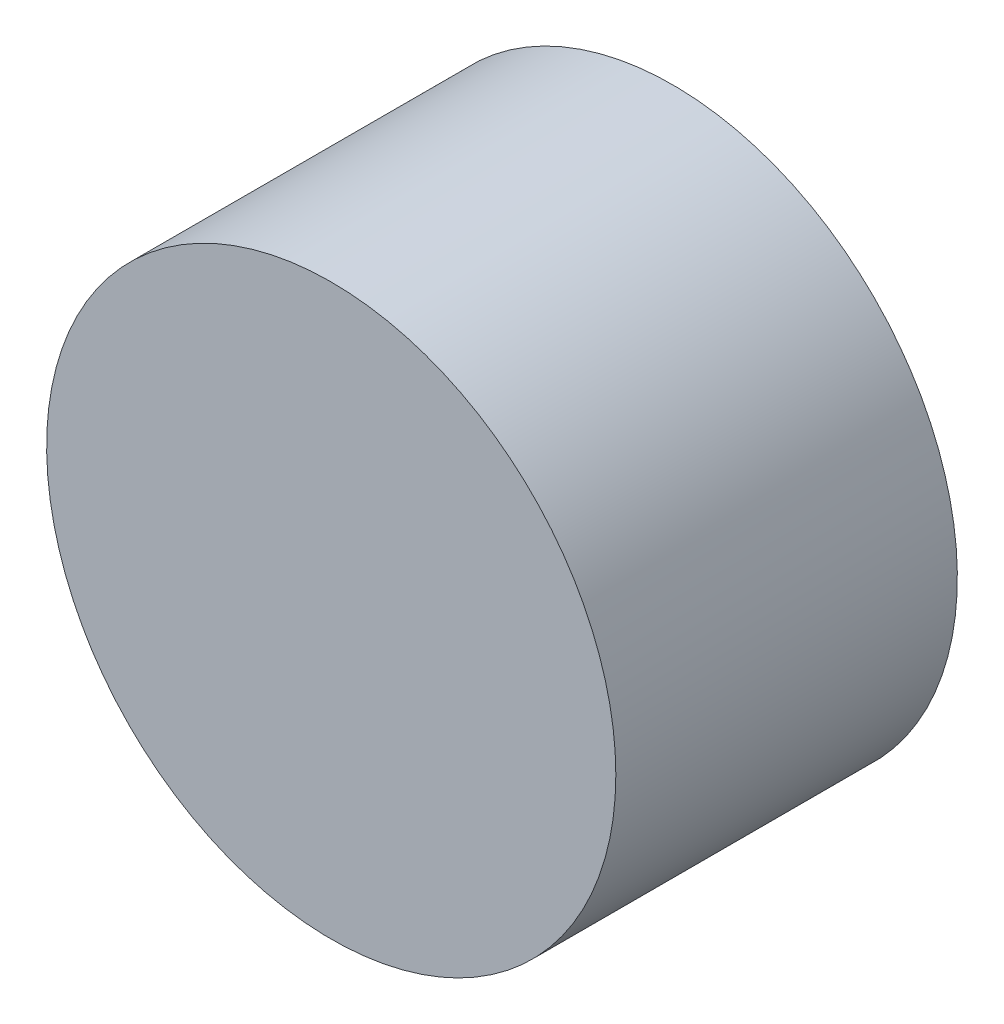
ISO-10303-21;
HEADER;
FILE_DESCRIPTION(('STEP AP214'),'2;1');
FILE_NAME('part.step','',(''),(''),'','','');
FILE_SCHEMA(('AUTOMOTIVE_DESIGN { 1 0 10303 214 1 1 1 1 }'));
ENDSEC;
DATA;
#1=APPLICATION_CONTEXT('core data for automotive mechanical design processes');
#2=APPLICATION_PROTOCOL_DEFINITION('international standard','automotive_design',2000,#1);
#3=PRODUCT_CONTEXT('',#1,'mechanical');
#4=PRODUCT('Part','Part','',(#3));
#5=PRODUCT_RELATED_PRODUCT_CATEGORY('part','',(#4));
#6=PRODUCT_DEFINITION_FORMATION('','',#4);
#7=PRODUCT_DEFINITION_CONTEXT('part definition',#1,'design');
#8=PRODUCT_DEFINITION('design','',#6,#7);
#9=PRODUCT_DEFINITION_SHAPE('','',#8);
#10=(LENGTH_UNIT() NAMED_UNIT(*) SI_UNIT(.MILLI.,.METRE.));
#11=(NAMED_UNIT(*) PLANE_ANGLE_UNIT() SI_UNIT($,.RADIAN.));
#12=(NAMED_UNIT(*) SI_UNIT($,.STERADIAN.) SOLID_ANGLE_UNIT());
#13=UNCERTAINTY_MEASURE_WITH_UNIT(LENGTH_MEASURE(1.E-05),#10,'distance_accuracy_value','');
#14=(GEOMETRIC_REPRESENTATION_CONTEXT(3) GLOBAL_UNCERTAINTY_ASSIGNED_CONTEXT((#13)) GLOBAL_UNIT_ASSIGNED_CONTEXT((#10,
#11,#12)) REPRESENTATION_CONTEXT('',''));
#15=CARTESIAN_POINT('',(0.,0.,0.));
#16=DIRECTION('',(0.,0.,1.));
#17=DIRECTION('',(1.,0.,0.));
#18=AXIS2_PLACEMENT_3D('',#15,#16,#17);
#19=CARTESIAN_POINT('',(0.,0.,6.));
#20=DIRECTION('',(0.,0.,-1.));
#21=DIRECTION('',(-1.,0.,0.));
#22=AXIS2_PLACEMENT_3D('',#19,#20,#21);
#23=CYLINDRICAL_SURFACE('',#22,5.);
#24=CARTESIAN_POINT('',(0.,0.,6.));
#25=DIRECTION('',(0.,0.,1.));
#26=DIRECTION('',(1.,0.,0.));
#27=AXIS2_PLACEMENT_3D('',#24,#25,#26);
#28=CIRCLE('',#27,5.);
#29=CARTESIAN_POINT('',(5.,0.,6.));
#30=VERTEX_POINT('',#29);
#31=EDGE_CURVE('E11',#30,#30,#28,.T.);
#32=ORIENTED_EDGE('',*,*,#31,.F.);
#33=EDGE_LOOP('',(#32));
#34=FACE_BOUND('',#33,.T.);
#35=CARTESIAN_POINT('',(0.,0.,1.));
#36=DIRECTION('',(0.,0.,-1.));
#37=DIRECTION('',(-1.,0.,0.));
#38=AXIS2_PLACEMENT_3D('',#35,#36,#37);
#39=CIRCLE('',#38,5.);
#40=CARTESIAN_POINT('',(-4.29969268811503,2.55198800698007,1.));
#41=VERTEX_POINT('',#40);
#42=CARTESIAN_POINT('',(-3.87934812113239,3.1544663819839,1.));
#43=VERTEX_POINT('',#42);
#44=EDGE_CURVE('E71',#41,#43,#39,.T.);
#45=ORIENTED_EDGE('',*,*,#44,.F.);
#46=DIRECTION('',(0.,0.,-1.));
#47=VECTOR('',#46,1.);
#48=CARTESIAN_POINT('',(-4.29969268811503,2.55198800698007,1.));
#49=LINE('',#48,#47);
#50=CARTESIAN_POINT('',(-4.29969268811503,2.55198800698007,0.));
#51=VERTEX_POINT('',#50);
#52=EDGE_CURVE('E62',#41,#51,#49,.T.);
#53=ORIENTED_EDGE('',*,*,#52,.T.);
#54=CARTESIAN_POINT('',(0.,0.,0.));
#55=DIRECTION('',(0.,0.,1.));
#56=DIRECTION('',(1.,0.,0.));
#57=AXIS2_PLACEMENT_3D('',#54,#55,#56);
#58=CIRCLE('',#57,5.);
#59=CARTESIAN_POINT('',(-3.87934812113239,3.1544663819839,0.));
#60=VERTEX_POINT('',#59);
#61=EDGE_CURVE('E33',#51,#60,#58,.T.);
#62=ORIENTED_EDGE('',*,*,#61,.T.);
#63=DIRECTION('',(0.,0.,-1.));
#64=VECTOR('',#63,1.);
#65=CARTESIAN_POINT('',(-3.87934812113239,3.1544663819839,1.));
#66=LINE('',#65,#64);
#67=EDGE_CURVE('E40',#43,#60,#66,.T.);
#68=ORIENTED_EDGE('',*,*,#67,.F.);
#69=EDGE_LOOP('',(#45,#53,#62,#68));
#70=FACE_BOUND('',#69,.T.);
#71=ADVANCED_FACE('F26',(#34,#70),#23,.T.);
#72=CARTESIAN_POINT('',(0.,0.,6.));
#73=DIRECTION('',(0.,0.,1.));
#74=DIRECTION('',(1.,0.,0.));
#75=AXIS2_PLACEMENT_3D('',#72,#73,#74);
#76=PLANE('',#75);
#77=ORIENTED_EDGE('',*,*,#31,.T.);
#78=EDGE_LOOP('',(#77));
#79=FACE_BOUND('',#78,.T.);
#80=ADVANCED_FACE('F95',(#79),#76,.T.);
#81=CARTESIAN_POINT('',(0.,0.,0.));
#82=DIRECTION('',(0.,0.,1.));
#83=DIRECTION('',(1.,0.,0.));
#84=AXIS2_PLACEMENT_3D('',#81,#82,#83);
#85=PLANE('',#84);
#86=ORIENTED_EDGE('',*,*,#61,.F.);
#87=DIRECTION('',(-0.859938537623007,0.510397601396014,0.));
#88=VECTOR('',#87,1.);
#89=CARTESIAN_POINT('',(0.,0.,0.));
#90=LINE('',#89,#88);
#91=CARTESIAN_POINT('',(0.,0.,0.));
#92=VERTEX_POINT('',#91);
#93=EDGE_CURVE('E59',#92,#51,#90,.T.);
#94=ORIENTED_EDGE('',*,*,#93,.F.);
#95=DIRECTION('',(0.775869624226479,-0.630893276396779,0.));
#96=VECTOR('',#95,1.);
#97=CARTESIAN_POINT('',(0.,0.,0.));
#98=LINE('',#97,#96);
#99=EDGE_CURVE('E66',#60,#92,#98,.T.);
#100=ORIENTED_EDGE('',*,*,#99,.F.);
#101=EDGE_LOOP('',(#86,#94,#100));
#102=FACE_BOUND('',#101,.T.);
#103=ADVANCED_FACE('F74',(#102),#85,.F.);
#104=CARTESIAN_POINT('',(0.,0.,1.));
#105=DIRECTION('',(-0.510397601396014,-0.859938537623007,0.));
#106=DIRECTION('',(0.859938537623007,-0.510397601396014,0.));
#107=AXIS2_PLACEMENT_3D('',#104,#105,#106);
#108=PLANE('',#107);
#109=ORIENTED_EDGE('',*,*,#93,.T.);
#110=ORIENTED_EDGE('',*,*,#52,.F.);
#111=DIRECTION('',(-0.859938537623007,0.510397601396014,0.));
#112=VECTOR('',#111,1.);
#113=CARTESIAN_POINT('',(0.,0.,1.));
#114=LINE('',#113,#112);
#115=CARTESIAN_POINT('',(0.,0.,1.));
#116=VERTEX_POINT('',#115);
#117=EDGE_CURVE('E81',#116,#41,#114,.T.);
#118=ORIENTED_EDGE('',*,*,#117,.F.);
#119=DIRECTION('',(0.,0.,-1.));
#120=VECTOR('',#119,1.);
#121=CARTESIAN_POINT('',(0.,0.,1.));
#122=LINE('',#121,#120);
#123=EDGE_CURVE('E45',#116,#92,#122,.T.);
#124=ORIENTED_EDGE('',*,*,#123,.T.);
#125=EDGE_LOOP('',(#109,#110,#118,#124));
#126=FACE_BOUND('',#125,.T.);
#127=ADVANCED_FACE('F61',(#126),#108,.F.);
#128=CARTESIAN_POINT('',(0.,0.,1.));
#129=DIRECTION('',(0.630893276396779,0.775869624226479,0.));
#130=DIRECTION('',(-0.775869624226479,0.630893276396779,0.));
#131=AXIS2_PLACEMENT_3D('',#128,#129,#130);
#132=PLANE('',#131);
#133=ORIENTED_EDGE('',*,*,#99,.T.);
#134=ORIENTED_EDGE('',*,*,#123,.F.);
#135=DIRECTION('',(0.775869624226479,-0.630893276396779,0.));
#136=VECTOR('',#135,1.);
#137=CARTESIAN_POINT('',(0.,0.,1.));
#138=LINE('',#137,#136);
#139=EDGE_CURVE('E72',#43,#116,#138,.T.);
#140=ORIENTED_EDGE('',*,*,#139,.F.);
#141=ORIENTED_EDGE('',*,*,#67,.T.);
#142=EDGE_LOOP('',(#133,#134,#140,#141));
#143=FACE_BOUND('',#142,.T.);
#144=ADVANCED_FACE('F83',(#143),#132,.F.);
#145=CARTESIAN_POINT('',(0.,0.,1.));
#146=DIRECTION('',(0.,0.,-1.));
#147=DIRECTION('',(-1.,0.,0.));
#148=AXIS2_PLACEMENT_3D('',#145,#146,#147);
#149=PLANE('',#148);
#150=ORIENTED_EDGE('',*,*,#117,.T.);
#151=ORIENTED_EDGE('',*,*,#44,.T.);
#152=ORIENTED_EDGE('',*,*,#139,.T.);
#153=EDGE_LOOP('',(#150,#151,#152));
#154=FACE_BOUND('',#153,.T.);
#155=ADVANCED_FACE('F85',(#154),#149,.T.);
#156=CLOSED_SHELL('',(#71,#80,#103,#127,#144,#155));
#157=MANIFOLD_SOLID_BREP('B2',#156);
#158=ADVANCED_BREP_SHAPE_REPRESENTATION('',(#18,#157),#14);
#159=SHAPE_DEFINITION_REPRESENTATION(#9,#158);
ENDSEC;
END-ISO-10303-21;
